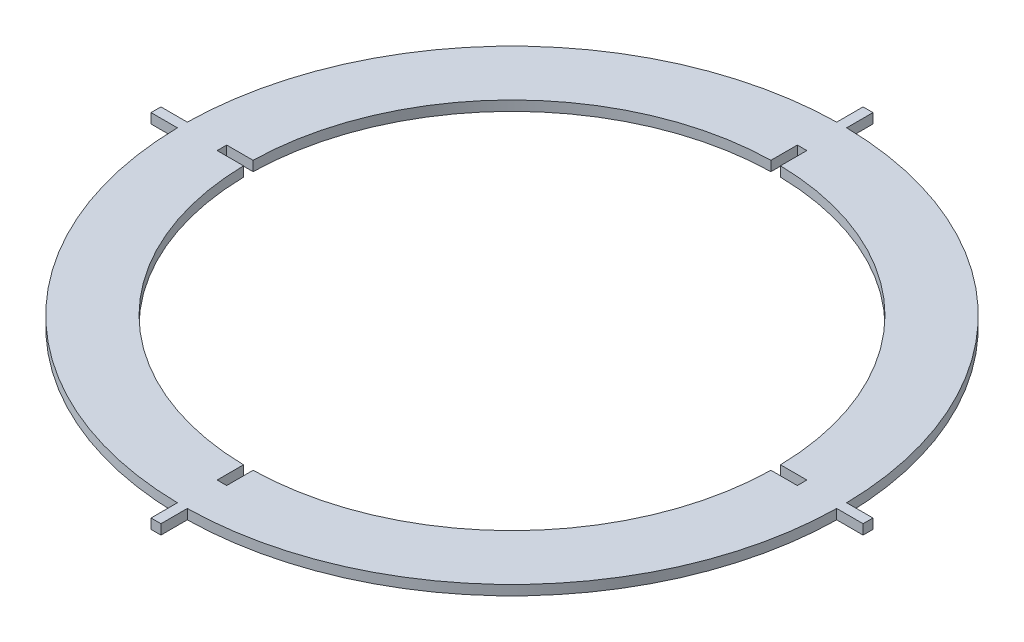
ISO-10303-21;
HEADER;
FILE_DESCRIPTION(('STEP AP214'),'2;1');
FILE_NAME('part.step','',(''),(''),'','','');
FILE_SCHEMA(('AUTOMOTIVE_DESIGN { 1 0 10303 214 1 1 1 1 }'));
ENDSEC;
DATA;
#1=APPLICATION_CONTEXT('core data for automotive mechanical design processes');
#2=APPLICATION_PROTOCOL_DEFINITION('international standard','automotive_design',2000,#1);
#3=PRODUCT_CONTEXT('',#1,'mechanical');
#4=PRODUCT('Part','Part','',(#3));
#5=PRODUCT_RELATED_PRODUCT_CATEGORY('part','',(#4));
#6=PRODUCT_DEFINITION_FORMATION('','',#4);
#7=PRODUCT_DEFINITION_CONTEXT('part definition',#1,'design');
#8=PRODUCT_DEFINITION('design','',#6,#7);
#9=PRODUCT_DEFINITION_SHAPE('','',#8);
#10=(LENGTH_UNIT() NAMED_UNIT(*) SI_UNIT(.MILLI.,.METRE.));
#11=(NAMED_UNIT(*) PLANE_ANGLE_UNIT() SI_UNIT($,.RADIAN.));
#12=(NAMED_UNIT(*) SI_UNIT($,.STERADIAN.) SOLID_ANGLE_UNIT());
#13=UNCERTAINTY_MEASURE_WITH_UNIT(LENGTH_MEASURE(1.E-05),#10,'distance_accuracy_value','');
#14=(GEOMETRIC_REPRESENTATION_CONTEXT(3) GLOBAL_UNCERTAINTY_ASSIGNED_CONTEXT((#13)) GLOBAL_UNIT_ASSIGNED_CONTEXT((#10,
#11,#12)) REPRESENTATION_CONTEXT('',''));
#15=CARTESIAN_POINT('',(0.,0.,0.));
#16=DIRECTION('',(0.,0.,1.));
#17=DIRECTION('',(1.,0.,0.));
#18=AXIS2_PLACEMENT_3D('',#15,#16,#17);
#19=CARTESIAN_POINT('',(0.,3.,-1.50000000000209));
#20=DIRECTION('',(0.,0.,1.));
#21=DIRECTION('',(1.,0.,0.));
#22=AXIS2_PLACEMENT_3D('',#19,#20,#21);
#23=PLANE('',#22);
#24=DIRECTION('',(-1.,0.,0.));
#25=VECTOR('',#24,1.);
#26=CARTESIAN_POINT('',(0.,0.,-1.50000000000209));
#27=LINE('',#26,#25);
#28=CARTESIAN_POINT('',(107.988749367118,0.,-1.5000000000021));
#29=VERTEX_POINT('',#28);
#30=CARTESIAN_POINT('',(99.9887493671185,0.,-1.5000000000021));
#31=VERTEX_POINT('',#30);
#32=EDGE_CURVE('E326',#29,#31,#27,.T.);
#33=ORIENTED_EDGE('',*,*,#32,.T.);
#34=DIRECTION('',(0.,-1.,0.));
#35=VECTOR('',#34,1.);
#36=CARTESIAN_POINT('',(99.9887493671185,3.,-1.5000000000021));
#37=LINE('',#36,#35);
#38=CARTESIAN_POINT('',(99.9887493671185,3.,-1.5000000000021));
#39=VERTEX_POINT('',#38);
#40=EDGE_CURVE('E11',#39,#31,#37,.T.);
#41=ORIENTED_EDGE('',*,*,#40,.F.);
#42=DIRECTION('',(-1.,0.,0.));
#43=VECTOR('',#42,1.);
#44=CARTESIAN_POINT('',(0.,3.,-1.50000000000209));
#45=LINE('',#44,#43);
#46=CARTESIAN_POINT('',(107.988749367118,3.,-1.5000000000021));
#47=VERTEX_POINT('',#46);
#48=EDGE_CURVE('E484',#47,#39,#45,.T.);
#49=ORIENTED_EDGE('',*,*,#48,.F.);
#50=DIRECTION('',(0.,-1.,0.));
#51=VECTOR('',#50,1.);
#52=CARTESIAN_POINT('',(107.988749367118,3.,-1.5000000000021));
#53=LINE('',#52,#51);
#54=EDGE_CURVE('E54',#47,#29,#53,.T.);
#55=ORIENTED_EDGE('',*,*,#54,.T.);
#56=EDGE_LOOP('',(#33,#41,#49,#55));
#57=FACE_BOUND('',#56,.T.);
#58=ADVANCED_FACE('F35',(#57),#23,.F.);
#59=CARTESIAN_POINT('',(0.,3.,0.));
#60=DIRECTION('',(0.,-1.,0.));
#61=DIRECTION('',(0.,0.,-1.));
#62=AXIS2_PLACEMENT_3D('',#59,#60,#61);
#63=CYLINDRICAL_SURFACE('',#62,100.000000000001);
#64=CARTESIAN_POINT('',(0.,0.,0.));
#65=DIRECTION('',(0.,1.,0.));
#66=DIRECTION('',(0.,0.,1.));
#67=AXIS2_PLACEMENT_3D('',#64,#65,#66);
#68=CIRCLE('',#67,100.000000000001);
#69=CARTESIAN_POINT('',(1.50000000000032,0.,-99.9887493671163));
#70=VERTEX_POINT('',#69);
#71=EDGE_CURVE('E328',#31,#70,#68,.T.);
#72=ORIENTED_EDGE('',*,*,#71,.T.);
#73=DIRECTION('',(0.,-1.,0.));
#74=VECTOR('',#73,1.);
#75=CARTESIAN_POINT('',(1.50000000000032,3.,-99.9887493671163));
#76=LINE('',#75,#74);
#77=CARTESIAN_POINT('',(1.50000000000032,3.,-99.9887493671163));
#78=VERTEX_POINT('',#77);
#79=EDGE_CURVE('E45',#78,#70,#76,.T.);
#80=ORIENTED_EDGE('',*,*,#79,.F.);
#81=CARTESIAN_POINT('',(0.,3.,0.));
#82=DIRECTION('',(0.,1.,0.));
#83=DIRECTION('',(0.,0.,1.));
#84=AXIS2_PLACEMENT_3D('',#81,#82,#83);
#85=CIRCLE('',#84,100.000000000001);
#86=EDGE_CURVE('E486',#39,#78,#85,.T.);
#87=ORIENTED_EDGE('',*,*,#86,.F.);
#88=ORIENTED_EDGE('',*,*,#40,.T.);
#89=EDGE_LOOP('',(#72,#80,#87,#88));
#90=FACE_BOUND('',#89,.T.);
#91=ADVANCED_FACE('F535',(#90),#63,.T.);
#92=CARTESIAN_POINT('',(1.49999999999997,3.,0.));
#93=DIRECTION('',(1.,0.,0.));
#94=DIRECTION('',(0.,0.,-1.));
#95=AXIS2_PLACEMENT_3D('',#92,#93,#94);
#96=PLANE('',#95);
#97=DIRECTION('',(0.,0.,1.));
#98=VECTOR('',#97,1.);
#99=CARTESIAN_POINT('',(1.49999999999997,0.,0.));
#100=LINE('',#99,#98);
#101=CARTESIAN_POINT('',(1.50000000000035,0.,-107.988749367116));
#102=VERTEX_POINT('',#101);
#103=EDGE_CURVE('E331',#102,#70,#100,.T.);
#104=ORIENTED_EDGE('',*,*,#103,.F.);
#105=DIRECTION('',(0.,-1.,0.));
#106=VECTOR('',#105,1.);
#107=CARTESIAN_POINT('',(1.50000000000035,3.,-107.988749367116));
#108=LINE('',#107,#106);
#109=CARTESIAN_POINT('',(1.50000000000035,3.,-107.988749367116));
#110=VERTEX_POINT('',#109);
#111=EDGE_CURVE('E391',#110,#102,#108,.T.);
#112=ORIENTED_EDGE('',*,*,#111,.F.);
#113=DIRECTION('',(0.,0.,1.));
#114=VECTOR('',#113,1.);
#115=CARTESIAN_POINT('',(1.49999999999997,3.,0.));
#116=LINE('',#115,#114);
#117=EDGE_CURVE('E488',#110,#78,#116,.T.);
#118=ORIENTED_EDGE('',*,*,#117,.T.);
#119=ORIENTED_EDGE('',*,*,#79,.T.);
#120=EDGE_LOOP('',(#104,#112,#118,#119));
#121=FACE_BOUND('',#120,.T.);
#122=ADVANCED_FACE('F540',(#121),#96,.T.);
#123=CARTESIAN_POINT('',(0.,3.,-107.988749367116));
#124=DIRECTION('',(0.,0.,-1.));
#125=DIRECTION('',(-1.,0.,0.));
#126=AXIS2_PLACEMENT_3D('',#123,#124,#125);
#127=PLANE('',#126);
#128=DIRECTION('',(1.,0.,0.));
#129=VECTOR('',#128,1.);
#130=CARTESIAN_POINT('',(0.,0.,-107.988749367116));
#131=LINE('',#130,#129);
#132=CARTESIAN_POINT('',(-1.49999999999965,0.,-107.988749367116));
#133=VERTEX_POINT('',#132);
#134=EDGE_CURVE('E334',#133,#102,#131,.T.);
#135=ORIENTED_EDGE('',*,*,#134,.F.);
#136=DIRECTION('',(0.,-1.,0.));
#137=VECTOR('',#136,1.);
#138=CARTESIAN_POINT('',(-1.49999999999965,3.,-107.988749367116));
#139=LINE('',#138,#137);
#140=CARTESIAN_POINT('',(-1.49999999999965,3.,-107.988749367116));
#141=VERTEX_POINT('',#140);
#142=EDGE_CURVE('E389',#141,#133,#139,.T.);
#143=ORIENTED_EDGE('',*,*,#142,.F.);
#144=DIRECTION('',(1.,0.,0.));
#145=VECTOR('',#144,1.);
#146=CARTESIAN_POINT('',(0.,3.,-107.988749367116));
#147=LINE('',#146,#145);
#148=EDGE_CURVE('E491',#141,#110,#147,.T.);
#149=ORIENTED_EDGE('',*,*,#148,.T.);
#150=ORIENTED_EDGE('',*,*,#111,.T.);
#151=EDGE_LOOP('',(#135,#143,#149,#150));
#152=FACE_BOUND('',#151,.T.);
#153=ADVANCED_FACE('F851',(#152),#127,.T.);
#154=CARTESIAN_POINT('',(-1.50000000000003,3.,0.));
#155=DIRECTION('',(1.,0.,0.));
#156=DIRECTION('',(0.,0.,-1.));
#157=AXIS2_PLACEMENT_3D('',#154,#155,#156);
#158=PLANE('',#157);
#159=DIRECTION('',(0.,0.,1.));
#160=VECTOR('',#159,1.);
#161=CARTESIAN_POINT('',(-1.50000000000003,0.,0.));
#162=LINE('',#161,#160);
#163=CARTESIAN_POINT('',(-1.49999999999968,0.,-99.9887493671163));
#164=VERTEX_POINT('',#163);
#165=EDGE_CURVE('E337',#133,#164,#162,.T.);
#166=ORIENTED_EDGE('',*,*,#165,.T.);
#167=DIRECTION('',(0.,-1.,0.));
#168=VECTOR('',#167,1.);
#169=CARTESIAN_POINT('',(-1.49999999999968,3.,-99.9887493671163));
#170=LINE('',#169,#168);
#171=CARTESIAN_POINT('',(-1.49999999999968,3.,-99.9887493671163));
#172=VERTEX_POINT('',#171);
#173=EDGE_CURVE('E386',#172,#164,#170,.T.);
#174=ORIENTED_EDGE('',*,*,#173,.F.);
#175=DIRECTION('',(0.,0.,1.));
#176=VECTOR('',#175,1.);
#177=CARTESIAN_POINT('',(-1.50000000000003,3.,0.));
#178=LINE('',#177,#176);
#179=EDGE_CURVE('E494',#141,#172,#178,.T.);
#180=ORIENTED_EDGE('',*,*,#179,.F.);
#181=ORIENTED_EDGE('',*,*,#142,.T.);
#182=EDGE_LOOP('',(#166,#174,#180,#181));
#183=FACE_BOUND('',#182,.T.);
#184=ADVANCED_FACE('F841',(#183),#158,.F.);
#185=CARTESIAN_POINT('',(0.,3.,0.));
#186=DIRECTION('',(0.,-1.,0.));
#187=DIRECTION('',(0.,0.,-1.));
#188=AXIS2_PLACEMENT_3D('',#185,#186,#187);
#189=CYLINDRICAL_SURFACE('',#188,100.);
#190=CARTESIAN_POINT('',(0.,0.,0.));
#191=DIRECTION('',(0.,1.,0.));
#192=DIRECTION('',(0.,0.,1.));
#193=AXIS2_PLACEMENT_3D('',#190,#191,#192);
#194=CIRCLE('',#193,100.);
#195=CARTESIAN_POINT('',(-99.9887493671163,0.,-1.49999999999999));
#196=VERTEX_POINT('',#195);
#197=EDGE_CURVE('E339',#164,#196,#194,.T.);
#198=ORIENTED_EDGE('',*,*,#197,.T.);
#199=DIRECTION('',(0.,-1.,0.));
#200=VECTOR('',#199,1.);
#201=CARTESIAN_POINT('',(-99.9887493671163,3.,-1.49999999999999));
#202=LINE('',#201,#200);
#203=CARTESIAN_POINT('',(-99.9887493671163,3.,-1.49999999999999));
#204=VERTEX_POINT('',#203);
#205=EDGE_CURVE('E384',#204,#196,#202,.T.);
#206=ORIENTED_EDGE('',*,*,#205,.F.);
#207=CARTESIAN_POINT('',(0.,3.,0.));
#208=DIRECTION('',(0.,1.,0.));
#209=DIRECTION('',(0.,0.,1.));
#210=AXIS2_PLACEMENT_3D('',#207,#208,#209);
#211=CIRCLE('',#210,100.);
#212=EDGE_CURVE('E496',#172,#204,#211,.T.);
#213=ORIENTED_EDGE('',*,*,#212,.F.);
#214=ORIENTED_EDGE('',*,*,#173,.T.);
#215=EDGE_LOOP('',(#198,#206,#213,#214));
#216=FACE_BOUND('',#215,.T.);
#217=ADVANCED_FACE('F831',(#216),#189,.T.);
#218=CARTESIAN_POINT('',(0.,3.,-1.49999999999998));
#219=DIRECTION('',(0.,0.,-1.));
#220=DIRECTION('',(-1.,0.,0.));
#221=AXIS2_PLACEMENT_3D('',#218,#219,#220);
#222=PLANE('',#221);
#223=DIRECTION('',(1.,0.,0.));
#224=VECTOR('',#223,1.);
#225=CARTESIAN_POINT('',(0.,0.,-1.49999999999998));
#226=LINE('',#225,#224);
#227=CARTESIAN_POINT('',(-107.988749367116,0.,-1.49999999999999));
#228=VERTEX_POINT('',#227);
#229=EDGE_CURVE('E342',#228,#196,#226,.T.);
#230=ORIENTED_EDGE('',*,*,#229,.F.);
#231=DIRECTION('',(0.,-1.,0.));
#232=VECTOR('',#231,1.);
#233=CARTESIAN_POINT('',(-107.988749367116,3.,-1.49999999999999));
#234=LINE('',#233,#232);
#235=CARTESIAN_POINT('',(-107.988749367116,3.,-1.49999999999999));
#236=VERTEX_POINT('',#235);
#237=EDGE_CURVE('E382',#236,#228,#234,.T.);
#238=ORIENTED_EDGE('',*,*,#237,.F.);
#239=DIRECTION('',(1.,0.,0.));
#240=VECTOR('',#239,1.);
#241=CARTESIAN_POINT('',(0.,3.,-1.49999999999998));
#242=LINE('',#241,#240);
#243=EDGE_CURVE('E498',#236,#204,#242,.T.);
#244=ORIENTED_EDGE('',*,*,#243,.T.);
#245=ORIENTED_EDGE('',*,*,#205,.T.);
#246=EDGE_LOOP('',(#230,#238,#244,#245));
#247=FACE_BOUND('',#246,.T.);
#248=ADVANCED_FACE('F821',(#247),#222,.T.);
#249=CARTESIAN_POINT('',(-107.988749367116,3.,0.));
#250=DIRECTION('',(-1.,0.,0.));
#251=DIRECTION('',(0.,0.,1.));
#252=AXIS2_PLACEMENT_3D('',#249,#250,#251);
#253=PLANE('',#252);
#254=DIRECTION('',(0.,0.,-1.));
#255=VECTOR('',#254,1.);
#256=CARTESIAN_POINT('',(-107.988749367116,0.,0.));
#257=LINE('',#256,#255);
#258=CARTESIAN_POINT('',(-107.988749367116,0.,1.50000000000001));
#259=VERTEX_POINT('',#258);
#260=EDGE_CURVE('E345',#259,#228,#257,.T.);
#261=ORIENTED_EDGE('',*,*,#260,.F.);
#262=DIRECTION('',(0.,-1.,0.));
#263=VECTOR('',#262,1.);
#264=CARTESIAN_POINT('',(-107.988749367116,3.,1.50000000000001));
#265=LINE('',#264,#263);
#266=CARTESIAN_POINT('',(-107.988749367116,3.,1.50000000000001));
#267=VERTEX_POINT('',#266);
#268=EDGE_CURVE('E380',#267,#259,#265,.T.);
#269=ORIENTED_EDGE('',*,*,#268,.F.);
#270=DIRECTION('',(0.,0.,-1.));
#271=VECTOR('',#270,1.);
#272=CARTESIAN_POINT('',(-107.988749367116,3.,0.));
#273=LINE('',#272,#271);
#274=EDGE_CURVE('E501',#267,#236,#273,.T.);
#275=ORIENTED_EDGE('',*,*,#274,.T.);
#276=ORIENTED_EDGE('',*,*,#237,.T.);
#277=EDGE_LOOP('',(#261,#269,#275,#276));
#278=FACE_BOUND('',#277,.T.);
#279=ADVANCED_FACE('F811',(#278),#253,.T.);
#280=CARTESIAN_POINT('',(0.,3.,1.50000000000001));
#281=DIRECTION('',(0.,0.,-1.));
#282=DIRECTION('',(-1.,0.,0.));
#283=AXIS2_PLACEMENT_3D('',#280,#281,#282);
#284=PLANE('',#283);
#285=DIRECTION('',(1.,0.,0.));
#286=VECTOR('',#285,1.);
#287=CARTESIAN_POINT('',(0.,0.,1.50000000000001));
#288=LINE('',#287,#286);
#289=CARTESIAN_POINT('',(-99.9887493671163,0.,1.50000000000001));
#290=VERTEX_POINT('',#289);
#291=EDGE_CURVE('E348',#259,#290,#288,.T.);
#292=ORIENTED_EDGE('',*,*,#291,.T.);
#293=DIRECTION('',(0.,-1.,0.));
#294=VECTOR('',#293,1.);
#295=CARTESIAN_POINT('',(-99.9887493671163,3.,1.50000000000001));
#296=LINE('',#295,#294);
#297=CARTESIAN_POINT('',(-99.9887493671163,3.,1.50000000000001));
#298=VERTEX_POINT('',#297);
#299=EDGE_CURVE('E377',#298,#290,#296,.T.);
#300=ORIENTED_EDGE('',*,*,#299,.F.);
#301=DIRECTION('',(1.,0.,0.));
#302=VECTOR('',#301,1.);
#303=CARTESIAN_POINT('',(0.,3.,1.50000000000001));
#304=LINE('',#303,#302);
#305=EDGE_CURVE('E504',#267,#298,#304,.T.);
#306=ORIENTED_EDGE('',*,*,#305,.F.);
#307=ORIENTED_EDGE('',*,*,#268,.T.);
#308=EDGE_LOOP('',(#292,#300,#306,#307));
#309=FACE_BOUND('',#308,.T.);
#310=ADVANCED_FACE('F801',(#309),#284,.F.);
#311=CARTESIAN_POINT('',(0.,3.,0.));
#312=DIRECTION('',(0.,-1.,0.));
#313=DIRECTION('',(0.,0.,-1.));
#314=AXIS2_PLACEMENT_3D('',#311,#312,#313);
#315=CYLINDRICAL_SURFACE('',#314,100.);
#316=CARTESIAN_POINT('',(0.,0.,0.));
#317=DIRECTION('',(0.,1.,0.));
#318=DIRECTION('',(0.,0.,1.));
#319=AXIS2_PLACEMENT_3D('',#316,#317,#318);
#320=CIRCLE('',#319,100.);
#321=CARTESIAN_POINT('',(-1.50000000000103,0.,99.9887493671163));
#322=VERTEX_POINT('',#321);
#323=EDGE_CURVE('E350',#290,#322,#320,.T.);
#324=ORIENTED_EDGE('',*,*,#323,.T.);
#325=DIRECTION('',(0.,-1.,0.));
#326=VECTOR('',#325,1.);
#327=CARTESIAN_POINT('',(-1.50000000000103,3.,99.9887493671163));
#328=LINE('',#327,#326);
#329=CARTESIAN_POINT('',(-1.50000000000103,3.,99.9887493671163));
#330=VERTEX_POINT('',#329);
#331=EDGE_CURVE('E375',#330,#322,#328,.T.);
#332=ORIENTED_EDGE('',*,*,#331,.F.);
#333=CARTESIAN_POINT('',(0.,3.,0.));
#334=DIRECTION('',(0.,1.,0.));
#335=DIRECTION('',(0.,0.,1.));
#336=AXIS2_PLACEMENT_3D('',#333,#334,#335);
#337=CIRCLE('',#336,100.);
#338=EDGE_CURVE('E506',#298,#330,#337,.T.);
#339=ORIENTED_EDGE('',*,*,#338,.F.);
#340=ORIENTED_EDGE('',*,*,#299,.T.);
#341=EDGE_LOOP('',(#324,#332,#339,#340));
#342=FACE_BOUND('',#341,.T.);
#343=ADVANCED_FACE('F791',(#342),#315,.T.);
#344=CARTESIAN_POINT('',(-1.49999999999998,3.,0.));
#345=DIRECTION('',(-1.,0.,0.));
#346=DIRECTION('',(0.,0.,1.));
#347=AXIS2_PLACEMENT_3D('',#344,#345,#346);
#348=PLANE('',#347);
#349=DIRECTION('',(0.,0.,-1.));
#350=VECTOR('',#349,1.);
#351=CARTESIAN_POINT('',(-1.49999999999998,0.,0.));
#352=LINE('',#351,#350);
#353=CARTESIAN_POINT('',(-1.50000000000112,0.,107.988749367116));
#354=VERTEX_POINT('',#353);
#355=EDGE_CURVE('E353',#354,#322,#352,.T.);
#356=ORIENTED_EDGE('',*,*,#355,.F.);
#357=DIRECTION('',(0.,-1.,0.));
#358=VECTOR('',#357,1.);
#359=CARTESIAN_POINT('',(-1.50000000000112,3.,107.988749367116));
#360=LINE('',#359,#358);
#361=CARTESIAN_POINT('',(-1.50000000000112,3.,107.988749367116));
#362=VERTEX_POINT('',#361);
#363=EDGE_CURVE('E373',#362,#354,#360,.T.);
#364=ORIENTED_EDGE('',*,*,#363,.F.);
#365=DIRECTION('',(0.,0.,-1.));
#366=VECTOR('',#365,1.);
#367=CARTESIAN_POINT('',(-1.49999999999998,3.,0.));
#368=LINE('',#367,#366);
#369=EDGE_CURVE('E508',#362,#330,#368,.T.);
#370=ORIENTED_EDGE('',*,*,#369,.T.);
#371=ORIENTED_EDGE('',*,*,#331,.T.);
#372=EDGE_LOOP('',(#356,#364,#370,#371));
#373=FACE_BOUND('',#372,.T.);
#374=ADVANCED_FACE('F521',(#373),#348,.T.);
#375=CARTESIAN_POINT('',(-9.99096632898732E-13,3.,107.988749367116));
#376=DIRECTION('',(0.,0.,1.));
#377=DIRECTION('',(1.,0.,0.));
#378=AXIS2_PLACEMENT_3D('',#375,#376,#377);
#379=PLANE('',#378);
#380=DIRECTION('',(-1.,0.,0.));
#381=VECTOR('',#380,1.);
#382=CARTESIAN_POINT('',(-9.99096632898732E-13,0.,107.988749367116));
#383=LINE('',#382,#381);
#384=CARTESIAN_POINT('',(1.49999999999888,0.,107.988749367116));
#385=VERTEX_POINT('',#384);
#386=EDGE_CURVE('E356',#385,#354,#383,.T.);
#387=ORIENTED_EDGE('',*,*,#386,.F.);
#388=DIRECTION('',(0.,-1.,0.));
#389=VECTOR('',#388,1.);
#390=CARTESIAN_POINT('',(1.49999999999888,3.,107.988749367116));
#391=LINE('',#390,#389);
#392=CARTESIAN_POINT('',(1.49999999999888,3.,107.988749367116));
#393=VERTEX_POINT('',#392);
#394=EDGE_CURVE('E371',#393,#385,#391,.T.);
#395=ORIENTED_EDGE('',*,*,#394,.F.);
#396=DIRECTION('',(-1.,0.,0.));
#397=VECTOR('',#396,1.);
#398=CARTESIAN_POINT('',(-9.99096632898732E-13,3.,107.988749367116));
#399=LINE('',#398,#397);
#400=EDGE_CURVE('E511',#393,#362,#399,.T.);
#401=ORIENTED_EDGE('',*,*,#400,.T.);
#402=ORIENTED_EDGE('',*,*,#363,.T.);
#403=EDGE_LOOP('',(#387,#395,#401,#402));
#404=FACE_BOUND('',#403,.T.);
#405=ADVANCED_FACE('F515',(#404),#379,.T.);
#406=CARTESIAN_POINT('',(1.50000000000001,3.,0.));
#407=DIRECTION('',(-1.,0.,0.));
#408=DIRECTION('',(0.,0.,1.));
#409=AXIS2_PLACEMENT_3D('',#406,#407,#408);
#410=PLANE('',#409);
#411=DIRECTION('',(0.,0.,-1.));
#412=VECTOR('',#411,1.);
#413=CARTESIAN_POINT('',(1.50000000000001,0.,0.));
#414=LINE('',#413,#412);
#415=CARTESIAN_POINT('',(1.49999999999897,0.,99.9887493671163));
#416=VERTEX_POINT('',#415);
#417=EDGE_CURVE('E359',#385,#416,#414,.T.);
#418=ORIENTED_EDGE('',*,*,#417,.T.);
#419=DIRECTION('',(0.,-1.,0.));
#420=VECTOR('',#419,1.);
#421=CARTESIAN_POINT('',(1.49999999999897,3.,99.9887493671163));
#422=LINE('',#421,#420);
#423=CARTESIAN_POINT('',(1.49999999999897,3.,99.9887493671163));
#424=VERTEX_POINT('',#423);
#425=EDGE_CURVE('E273',#424,#416,#422,.T.);
#426=ORIENTED_EDGE('',*,*,#425,.F.);
#427=DIRECTION('',(0.,0.,-1.));
#428=VECTOR('',#427,1.);
#429=CARTESIAN_POINT('',(1.50000000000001,3.,0.));
#430=LINE('',#429,#428);
#431=EDGE_CURVE('E261',#393,#424,#430,.T.);
#432=ORIENTED_EDGE('',*,*,#431,.F.);
#433=ORIENTED_EDGE('',*,*,#394,.T.);
#434=EDGE_LOOP('',(#418,#426,#432,#433));
#435=FACE_BOUND('',#434,.T.);
#436=ADVANCED_FACE('F525',(#435),#410,.F.);
#437=CARTESIAN_POINT('',(0.,3.,0.));
#438=DIRECTION('',(0.,-1.,0.));
#439=DIRECTION('',(0.,0.,-1.));
#440=AXIS2_PLACEMENT_3D('',#437,#438,#439);
#441=CYLINDRICAL_SURFACE('',#440,100.000000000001);
#442=CARTESIAN_POINT('',(0.,0.,0.));
#443=DIRECTION('',(0.,1.,0.));
#444=DIRECTION('',(0.,0.,1.));
#445=AXIS2_PLACEMENT_3D('',#442,#443,#444);
#446=CIRCLE('',#445,100.000000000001);
#447=CARTESIAN_POINT('',(99.9887493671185,0.,1.4999999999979));
#448=VERTEX_POINT('',#447);
#449=EDGE_CURVE('E270',#416,#448,#446,.T.);
#450=ORIENTED_EDGE('',*,*,#449,.T.);
#451=DIRECTION('',(0.,-1.,0.));
#452=VECTOR('',#451,1.);
#453=CARTESIAN_POINT('',(99.9887493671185,3.,1.4999999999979));
#454=LINE('',#453,#452);
#455=CARTESIAN_POINT('',(99.9887493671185,3.,1.4999999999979));
#456=VERTEX_POINT('',#455);
#457=EDGE_CURVE('E267',#456,#448,#454,.T.);
#458=ORIENTED_EDGE('',*,*,#457,.F.);
#459=CARTESIAN_POINT('',(0.,3.,0.));
#460=DIRECTION('',(0.,1.,0.));
#461=DIRECTION('',(0.,0.,1.));
#462=AXIS2_PLACEMENT_3D('',#459,#460,#461);
#463=CIRCLE('',#462,100.000000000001);
#464=EDGE_CURVE('E252',#424,#456,#463,.T.);
#465=ORIENTED_EDGE('',*,*,#464,.F.);
#466=ORIENTED_EDGE('',*,*,#425,.T.);
#467=EDGE_LOOP('',(#450,#458,#465,#466));
#468=FACE_BOUND('',#467,.T.);
#469=ADVANCED_FACE('F268',(#468),#441,.T.);
#470=CARTESIAN_POINT('',(0.,3.,1.49999999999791));
#471=DIRECTION('',(0.,0.,1.));
#472=DIRECTION('',(1.,0.,0.));
#473=AXIS2_PLACEMENT_3D('',#470,#471,#472);
#474=PLANE('',#473);
#475=DIRECTION('',(-1.,0.,0.));
#476=VECTOR('',#475,1.);
#477=CARTESIAN_POINT('',(0.,0.,1.49999999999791));
#478=LINE('',#477,#476);
#479=CARTESIAN_POINT('',(107.988749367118,0.,1.4999999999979));
#480=VERTEX_POINT('',#479);
#481=EDGE_CURVE('E362',#480,#448,#478,.T.);
#482=ORIENTED_EDGE('',*,*,#481,.F.);
#483=DIRECTION('',(0.,-1.,0.));
#484=VECTOR('',#483,1.);
#485=CARTESIAN_POINT('',(107.988749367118,3.,1.4999999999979));
#486=LINE('',#485,#484);
#487=CARTESIAN_POINT('',(107.988749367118,3.,1.4999999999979));
#488=VERTEX_POINT('',#487);
#489=EDGE_CURVE('E152',#488,#480,#486,.T.);
#490=ORIENTED_EDGE('',*,*,#489,.F.);
#491=DIRECTION('',(-1.,0.,0.));
#492=VECTOR('',#491,1.);
#493=CARTESIAN_POINT('',(0.,3.,1.49999999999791));
#494=LINE('',#493,#492);
#495=EDGE_CURVE('E258',#488,#456,#494,.T.);
#496=ORIENTED_EDGE('',*,*,#495,.T.);
#497=ORIENTED_EDGE('',*,*,#457,.T.);
#498=EDGE_LOOP('',(#482,#490,#496,#497));
#499=FACE_BOUND('',#498,.T.);
#500=ADVANCED_FACE('F275',(#499),#474,.T.);
#501=CARTESIAN_POINT('',(0.,3.,0.));
#502=DIRECTION('',(0.,-1.,0.));
#503=DIRECTION('',(0.,0.,-1.));
#504=AXIS2_PLACEMENT_3D('',#501,#502,#503);
#505=CYLINDRICAL_SURFACE('',#504,80.);
#506=CARTESIAN_POINT('',(0.,0.,0.));
#507=DIRECTION('',(0.,1.,0.));
#508=DIRECTION('',(0.,0.,1.));
#509=AXIS2_PLACEMENT_3D('',#506,#507,#508);
#510=CIRCLE('',#509,80.);
#511=CARTESIAN_POINT('',(79.9868582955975,0.,-1.45000000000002));
#512=VERTEX_POINT('',#511);
#513=CARTESIAN_POINT('',(1.44999999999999,0.,-79.9868582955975));
#514=VERTEX_POINT('',#513);
#515=EDGE_CURVE('E282',#512,#514,#510,.T.);
#516=ORIENTED_EDGE('',*,*,#515,.F.);
#517=DIRECTION('',(0.,-1.,0.));
#518=VECTOR('',#517,1.);
#519=CARTESIAN_POINT('',(79.9868582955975,3.,-1.45000000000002));
#520=LINE('',#519,#518);
#521=CARTESIAN_POINT('',(79.9868582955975,3.,-1.45000000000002));
#522=VERTEX_POINT('',#521);
#523=EDGE_CURVE('E39',#522,#512,#520,.T.);
#524=ORIENTED_EDGE('',*,*,#523,.F.);
#525=CARTESIAN_POINT('',(0.,3.,0.));
#526=DIRECTION('',(0.,1.,0.));
#527=DIRECTION('',(0.,0.,1.));
#528=AXIS2_PLACEMENT_3D('',#525,#526,#527);
#529=CIRCLE('',#528,80.);
#530=CARTESIAN_POINT('',(1.44999999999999,3.,-79.9868582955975));
#531=VERTEX_POINT('',#530);
#532=EDGE_CURVE('E367',#522,#531,#529,.T.);
#533=ORIENTED_EDGE('',*,*,#532,.T.);
#534=DIRECTION('',(0.,-1.,0.));
#535=VECTOR('',#534,1.);
#536=CARTESIAN_POINT('',(1.44999999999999,3.,-79.9868582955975));
#537=LINE('',#536,#535);
#538=EDGE_CURVE('E278',#531,#514,#537,.T.);
#539=ORIENTED_EDGE('',*,*,#538,.T.);
#540=EDGE_LOOP('',(#516,#524,#533,#539));
#541=FACE_BOUND('',#540,.T.);
#542=ADVANCED_FACE('F37',(#541),#505,.F.);
#543=CARTESIAN_POINT('',(0.,3.,-1.45000000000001));
#544=DIRECTION('',(0.,0.,1.));
#545=DIRECTION('',(1.,0.,0.));
#546=AXIS2_PLACEMENT_3D('',#543,#544,#545);
#547=PLANE('',#546);
#548=DIRECTION('',(-1.,0.,0.));
#549=VECTOR('',#548,1.);
#550=CARTESIAN_POINT('',(0.,0.,-1.45000000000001));
#551=LINE('',#550,#549);
#552=CARTESIAN_POINT('',(87.9868582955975,0.,-1.45000000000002));
#553=VERTEX_POINT('',#552);
#554=EDGE_CURVE('E285',#553,#512,#551,.T.);
#555=ORIENTED_EDGE('',*,*,#554,.F.);
#556=DIRECTION('',(0.,-1.,0.));
#557=VECTOR('',#556,1.);
#558=CARTESIAN_POINT('',(87.9868582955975,3.,-1.45000000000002));
#559=LINE('',#558,#557);
#560=CARTESIAN_POINT('',(87.9868582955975,3.,-1.45000000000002));
#561=VERTEX_POINT('',#560);
#562=EDGE_CURVE('E424',#561,#553,#559,.T.);
#563=ORIENTED_EDGE('',*,*,#562,.F.);
#564=DIRECTION('',(-1.,0.,0.));
#565=VECTOR('',#564,1.);
#566=CARTESIAN_POINT('',(0.,3.,-1.45000000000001));
#567=LINE('',#566,#565);
#568=EDGE_CURVE('E433',#561,#522,#567,.T.);
#569=ORIENTED_EDGE('',*,*,#568,.T.);
#570=ORIENTED_EDGE('',*,*,#523,.T.);
#571=EDGE_LOOP('',(#555,#563,#569,#570));
#572=FACE_BOUND('',#571,.T.);
#573=ADVANCED_FACE('F431',(#572),#547,.T.);
#574=CARTESIAN_POINT('',(87.9868582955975,3.,4.2105618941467E-13));
#575=DIRECTION('',(1.,0.,0.));
#576=DIRECTION('',(0.,0.,-1.));
#577=AXIS2_PLACEMENT_3D('',#574,#575,#576);
#578=PLANE('',#577);
#579=DIRECTION('',(0.,0.,1.));
#580=VECTOR('',#579,1.);
#581=CARTESIAN_POINT('',(87.9868582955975,0.,4.2105618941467E-13));
#582=LINE('',#581,#580);
#583=CARTESIAN_POINT('',(87.9868582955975,0.,1.44999999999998));
#584=VERTEX_POINT('',#583);
#585=EDGE_CURVE('E288',#553,#584,#582,.T.);
#586=ORIENTED_EDGE('',*,*,#585,.T.);
#587=DIRECTION('',(0.,-1.,0.));
#588=VECTOR('',#587,1.);
#589=CARTESIAN_POINT('',(87.9868582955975,3.,1.44999999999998));
#590=LINE('',#589,#588);
#591=CARTESIAN_POINT('',(87.9868582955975,3.,1.44999999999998));
#592=VERTEX_POINT('',#591);
#593=EDGE_CURVE('E422',#592,#584,#590,.T.);
#594=ORIENTED_EDGE('',*,*,#593,.F.);
#595=DIRECTION('',(0.,0.,1.));
#596=VECTOR('',#595,1.);
#597=CARTESIAN_POINT('',(87.9868582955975,3.,4.2105618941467E-13));
#598=LINE('',#597,#596);
#599=EDGE_CURVE('E451',#561,#592,#598,.T.);
#600=ORIENTED_EDGE('',*,*,#599,.F.);
#601=ORIENTED_EDGE('',*,*,#562,.T.);
#602=EDGE_LOOP('',(#586,#594,#600,#601));
#603=FACE_BOUND('',#602,.T.);
#604=ADVANCED_FACE('F441',(#603),#578,.F.);
#605=CARTESIAN_POINT('',(0.,3.,1.45000000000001));
#606=DIRECTION('',(0.,0.,1.));
#607=DIRECTION('',(1.,0.,0.));
#608=AXIS2_PLACEMENT_3D('',#605,#606,#607);
#609=PLANE('',#608);
#610=DIRECTION('',(-1.,0.,0.));
#611=VECTOR('',#610,1.);
#612=CARTESIAN_POINT('',(0.,0.,1.45000000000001));
#613=LINE('',#612,#611);
#614=CARTESIAN_POINT('',(79.9868582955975,0.,1.44999999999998));
#615=VERTEX_POINT('',#614);
#616=EDGE_CURVE('E290',#584,#615,#613,.T.);
#617=ORIENTED_EDGE('',*,*,#616,.T.);
#618=DIRECTION('',(0.,-1.,0.));
#619=VECTOR('',#618,1.);
#620=CARTESIAN_POINT('',(79.9868582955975,3.,1.44999999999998));
#621=LINE('',#620,#619);
#622=CARTESIAN_POINT('',(79.9868582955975,3.,1.44999999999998));
#623=VERTEX_POINT('',#622);
#624=EDGE_CURVE('E420',#623,#615,#621,.T.);
#625=ORIENTED_EDGE('',*,*,#624,.F.);
#626=DIRECTION('',(-1.,0.,0.));
#627=VECTOR('',#626,1.);
#628=CARTESIAN_POINT('',(0.,3.,1.45000000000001));
#629=LINE('',#628,#627);
#630=EDGE_CURVE('E446',#592,#623,#629,.T.);
#631=ORIENTED_EDGE('',*,*,#630,.F.);
#632=ORIENTED_EDGE('',*,*,#593,.T.);
#633=EDGE_LOOP('',(#617,#625,#631,#632));
#634=FACE_BOUND('',#633,.T.);
#635=ADVANCED_FACE('F444',(#634),#609,.F.);
#636=CARTESIAN_POINT('',(0.,3.,0.));
#637=DIRECTION('',(0.,-1.,0.));
#638=DIRECTION('',(0.,0.,-1.));
#639=AXIS2_PLACEMENT_3D('',#636,#637,#638);
#640=CYLINDRICAL_SURFACE('',#639,80.);
#641=CARTESIAN_POINT('',(0.,0.,0.));
#642=DIRECTION('',(0.,1.,0.));
#643=DIRECTION('',(0.,0.,1.));
#644=AXIS2_PLACEMENT_3D('',#641,#642,#643);
#645=CIRCLE('',#644,80.);
#646=CARTESIAN_POINT('',(1.45000000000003,0.,79.9868582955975));
#647=VERTEX_POINT('',#646);
#648=EDGE_CURVE('E293',#647,#615,#645,.T.);
#649=ORIENTED_EDGE('',*,*,#648,.F.);
#650=DIRECTION('',(0.,-1.,0.));
#651=VECTOR('',#650,1.);
#652=CARTESIAN_POINT('',(1.45000000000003,3.,79.9868582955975));
#653=LINE('',#652,#651);
#654=CARTESIAN_POINT('',(1.45000000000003,3.,79.9868582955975));
#655=VERTEX_POINT('',#654);
#656=EDGE_CURVE('E418',#655,#647,#653,.T.);
#657=ORIENTED_EDGE('',*,*,#656,.F.);
#658=CARTESIAN_POINT('',(0.,3.,0.));
#659=DIRECTION('',(0.,1.,0.));
#660=DIRECTION('',(0.,0.,1.));
#661=AXIS2_PLACEMENT_3D('',#658,#659,#660);
#662=CIRCLE('',#661,80.);
#663=EDGE_CURVE('E450',#655,#623,#662,.T.);
#664=ORIENTED_EDGE('',*,*,#663,.T.);
#665=ORIENTED_EDGE('',*,*,#624,.T.);
#666=EDGE_LOOP('',(#649,#657,#664,#665));
#667=FACE_BOUND('',#666,.T.);
#668=ADVANCED_FACE('F589',(#667),#640,.F.);
#669=CARTESIAN_POINT('',(1.45000000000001,3.,0.));
#670=DIRECTION('',(-1.,0.,0.));
#671=DIRECTION('',(0.,0.,1.));
#672=AXIS2_PLACEMENT_3D('',#669,#670,#671);
#673=PLANE('',#672);
#674=DIRECTION('',(0.,0.,-1.));
#675=VECTOR('',#674,1.);
#676=CARTESIAN_POINT('',(1.45000000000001,0.,0.));
#677=LINE('',#676,#675);
#678=CARTESIAN_POINT('',(1.45000000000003,0.,87.9868582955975));
#679=VERTEX_POINT('',#678);
#680=EDGE_CURVE('E296',#679,#647,#677,.T.);
#681=ORIENTED_EDGE('',*,*,#680,.F.);
#682=DIRECTION('',(0.,-1.,0.));
#683=VECTOR('',#682,1.);
#684=CARTESIAN_POINT('',(1.45000000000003,3.,87.9868582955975));
#685=LINE('',#684,#683);
#686=CARTESIAN_POINT('',(1.45000000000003,3.,87.9868582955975));
#687=VERTEX_POINT('',#686);
#688=EDGE_CURVE('E416',#687,#679,#685,.T.);
#689=ORIENTED_EDGE('',*,*,#688,.F.);
#690=DIRECTION('',(0.,0.,-1.));
#691=VECTOR('',#690,1.);
#692=CARTESIAN_POINT('',(1.45000000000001,3.,0.));
#693=LINE('',#692,#691);
#694=EDGE_CURVE('E453',#687,#655,#693,.T.);
#695=ORIENTED_EDGE('',*,*,#694,.T.);
#696=ORIENTED_EDGE('',*,*,#656,.T.);
#697=EDGE_LOOP('',(#681,#689,#695,#696));
#698=FACE_BOUND('',#697,.T.);
#699=ADVANCED_FACE('F585',(#698),#673,.T.);
#700=CARTESIAN_POINT('',(-4.2105618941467E-13,3.,87.9868582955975));
#701=DIRECTION('',(0.,0.,1.));
#702=DIRECTION('',(1.,0.,0.));
#703=AXIS2_PLACEMENT_3D('',#700,#701,#702);
#704=PLANE('',#703);
#705=DIRECTION('',(-1.,0.,0.));
#706=VECTOR('',#705,1.);
#707=CARTESIAN_POINT('',(-4.2105618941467E-13,0.,87.9868582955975));
#708=LINE('',#707,#706);
#709=CARTESIAN_POINT('',(-1.44999999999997,0.,87.9868582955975));
#710=VERTEX_POINT('',#709);
#711=EDGE_CURVE('E299',#679,#710,#708,.T.);
#712=ORIENTED_EDGE('',*,*,#711,.T.);
#713=DIRECTION('',(0.,-1.,0.));
#714=VECTOR('',#713,1.);
#715=CARTESIAN_POINT('',(-1.44999999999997,3.,87.9868582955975));
#716=LINE('',#715,#714);
#717=CARTESIAN_POINT('',(-1.44999999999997,3.,87.9868582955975));
#718=VERTEX_POINT('',#717);
#719=EDGE_CURVE('E413',#718,#710,#716,.T.);
#720=ORIENTED_EDGE('',*,*,#719,.F.);
#721=DIRECTION('',(-1.,0.,0.));
#722=VECTOR('',#721,1.);
#723=CARTESIAN_POINT('',(-4.2105618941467E-13,3.,87.9868582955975));
#724=LINE('',#723,#722);
#725=EDGE_CURVE('E460',#687,#718,#724,.T.);
#726=ORIENTED_EDGE('',*,*,#725,.F.);
#727=ORIENTED_EDGE('',*,*,#688,.T.);
#728=EDGE_LOOP('',(#712,#720,#726,#727));
#729=FACE_BOUND('',#728,.T.);
#730=ADVANCED_FACE('F581',(#729),#704,.F.);
#731=CARTESIAN_POINT('',(-1.45000000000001,3.,0.));
#732=DIRECTION('',(-1.,0.,0.));
#733=DIRECTION('',(0.,0.,1.));
#734=AXIS2_PLACEMENT_3D('',#731,#732,#733);
#735=PLANE('',#734);
#736=DIRECTION('',(0.,0.,-1.));
#737=VECTOR('',#736,1.);
#738=CARTESIAN_POINT('',(-1.45000000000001,0.,0.));
#739=LINE('',#738,#737);
#740=CARTESIAN_POINT('',(-1.44999999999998,0.,79.9868582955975));
#741=VERTEX_POINT('',#740);
#742=EDGE_CURVE('E301',#710,#741,#739,.T.);
#743=ORIENTED_EDGE('',*,*,#742,.T.);
#744=DIRECTION('',(0.,-1.,0.));
#745=VECTOR('',#744,1.);
#746=CARTESIAN_POINT('',(-1.44999999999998,3.,79.9868582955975));
#747=LINE('',#746,#745);
#748=CARTESIAN_POINT('',(-1.44999999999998,3.,79.9868582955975));
#749=VERTEX_POINT('',#748);
#750=EDGE_CURVE('E411',#749,#741,#747,.T.);
#751=ORIENTED_EDGE('',*,*,#750,.F.);
#752=DIRECTION('',(0.,0.,-1.));
#753=VECTOR('',#752,1.);
#754=CARTESIAN_POINT('',(-1.45000000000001,3.,0.));
#755=LINE('',#754,#753);
#756=EDGE_CURVE('E462',#718,#749,#755,.T.);
#757=ORIENTED_EDGE('',*,*,#756,.F.);
#758=ORIENTED_EDGE('',*,*,#719,.T.);
#759=EDGE_LOOP('',(#743,#751,#757,#758));
#760=FACE_BOUND('',#759,.T.);
#761=ADVANCED_FACE('F577',(#760),#735,.F.);
#762=CARTESIAN_POINT('',(0.,3.,0.));
#763=DIRECTION('',(0.,-1.,0.));
#764=DIRECTION('',(0.,0.,-1.));
#765=AXIS2_PLACEMENT_3D('',#762,#763,#764);
#766=CYLINDRICAL_SURFACE('',#765,80.);
#767=CARTESIAN_POINT('',(0.,0.,0.));
#768=DIRECTION('',(0.,1.,0.));
#769=DIRECTION('',(0.,0.,1.));
#770=AXIS2_PLACEMENT_3D('',#767,#768,#769);
#771=CIRCLE('',#770,80.);
#772=CARTESIAN_POINT('',(-79.9868582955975,0.,1.45000000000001));
#773=VERTEX_POINT('',#772);
#774=EDGE_CURVE('E304',#773,#741,#771,.T.);
#775=ORIENTED_EDGE('',*,*,#774,.F.);
#776=DIRECTION('',(0.,-1.,0.));
#777=VECTOR('',#776,1.);
#778=CARTESIAN_POINT('',(-79.9868582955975,3.,1.45000000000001));
#779=LINE('',#778,#777);
#780=CARTESIAN_POINT('',(-79.9868582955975,3.,1.45000000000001));
#781=VERTEX_POINT('',#780);
#782=EDGE_CURVE('E409',#781,#773,#779,.T.);
#783=ORIENTED_EDGE('',*,*,#782,.F.);
#784=CARTESIAN_POINT('',(0.,3.,0.));
#785=DIRECTION('',(0.,1.,0.));
#786=DIRECTION('',(0.,0.,1.));
#787=AXIS2_PLACEMENT_3D('',#784,#785,#786);
#788=CIRCLE('',#787,80.);
#789=EDGE_CURVE('E464',#781,#749,#788,.T.);
#790=ORIENTED_EDGE('',*,*,#789,.T.);
#791=ORIENTED_EDGE('',*,*,#750,.T.);
#792=EDGE_LOOP('',(#775,#783,#790,#791));
#793=FACE_BOUND('',#792,.T.);
#794=ADVANCED_FACE('F573',(#793),#766,.F.);
#795=CARTESIAN_POINT('',(0.,3.,1.45000000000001));
#796=DIRECTION('',(0.,0.,-1.));
#797=DIRECTION('',(-1.,0.,0.));
#798=AXIS2_PLACEMENT_3D('',#795,#796,#797);
#799=PLANE('',#798);
#800=DIRECTION('',(1.,0.,0.));
#801=VECTOR('',#800,1.);
#802=CARTESIAN_POINT('',(0.,0.,1.45000000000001));
#803=LINE('',#802,#801);
#804=CARTESIAN_POINT('',(-87.9868582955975,0.,1.45000000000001));
#805=VERTEX_POINT('',#804);
#806=EDGE_CURVE('E307',#805,#773,#803,.T.);
#807=ORIENTED_EDGE('',*,*,#806,.F.);
#808=DIRECTION('',(0.,-1.,0.));
#809=VECTOR('',#808,1.);
#810=CARTESIAN_POINT('',(-87.9868582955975,3.,1.45000000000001));
#811=LINE('',#810,#809);
#812=CARTESIAN_POINT('',(-87.9868582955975,3.,1.45000000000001));
#813=VERTEX_POINT('',#812);
#814=EDGE_CURVE('E407',#813,#805,#811,.T.);
#815=ORIENTED_EDGE('',*,*,#814,.F.);
#816=DIRECTION('',(1.,0.,0.));
#817=VECTOR('',#816,1.);
#818=CARTESIAN_POINT('',(0.,3.,1.45000000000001));
#819=LINE('',#818,#817);
#820=EDGE_CURVE('E467',#813,#781,#819,.T.);
#821=ORIENTED_EDGE('',*,*,#820,.T.);
#822=ORIENTED_EDGE('',*,*,#782,.T.);
#823=EDGE_LOOP('',(#807,#815,#821,#822));
#824=FACE_BOUND('',#823,.T.);
#825=ADVANCED_FACE('F569',(#824),#799,.T.);
#826=CARTESIAN_POINT('',(-87.9868582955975,3.,-4.2105618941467E-13));
#827=DIRECTION('',(-1.,0.,0.));
#828=DIRECTION('',(0.,0.,1.));
#829=AXIS2_PLACEMENT_3D('',#826,#827,#828);
#830=PLANE('',#829);
#831=DIRECTION('',(0.,0.,-1.));
#832=VECTOR('',#831,1.);
#833=CARTESIAN_POINT('',(-87.9868582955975,0.,-4.2105618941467E-13));
#834=LINE('',#833,#832);
#835=CARTESIAN_POINT('',(-87.9868582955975,0.,-1.44999999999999));
#836=VERTEX_POINT('',#835);
#837=EDGE_CURVE('E310',#805,#836,#834,.T.);
#838=ORIENTED_EDGE('',*,*,#837,.T.);
#839=DIRECTION('',(0.,-1.,0.));
#840=VECTOR('',#839,1.);
#841=CARTESIAN_POINT('',(-87.9868582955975,3.,-1.44999999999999));
#842=LINE('',#841,#840);
#843=CARTESIAN_POINT('',(-87.9868582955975,3.,-1.44999999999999));
#844=VERTEX_POINT('',#843);
#845=EDGE_CURVE('E404',#844,#836,#842,.T.);
#846=ORIENTED_EDGE('',*,*,#845,.F.);
#847=DIRECTION('',(0.,0.,-1.));
#848=VECTOR('',#847,1.);
#849=CARTESIAN_POINT('',(-87.9868582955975,3.,-4.2105618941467E-13));
#850=LINE('',#849,#848);
#851=EDGE_CURVE('E470',#813,#844,#850,.T.);
#852=ORIENTED_EDGE('',*,*,#851,.F.);
#853=ORIENTED_EDGE('',*,*,#814,.T.);
#854=EDGE_LOOP('',(#838,#846,#852,#853));
#855=FACE_BOUND('',#854,.T.);
#856=ADVANCED_FACE('F565',(#855),#830,.F.);
#857=CARTESIAN_POINT('',(0.,3.,-1.45000000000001));
#858=DIRECTION('',(0.,0.,-1.));
#859=DIRECTION('',(-1.,0.,0.));
#860=AXIS2_PLACEMENT_3D('',#857,#858,#859);
#861=PLANE('',#860);
#862=DIRECTION('',(1.,0.,0.));
#863=VECTOR('',#862,1.);
#864=CARTESIAN_POINT('',(0.,0.,-1.45000000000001));
#865=LINE('',#864,#863);
#866=CARTESIAN_POINT('',(-79.9868582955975,0.,-1.44999999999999));
#867=VERTEX_POINT('',#866);
#868=EDGE_CURVE('E312',#836,#867,#865,.T.);
#869=ORIENTED_EDGE('',*,*,#868,.T.);
#870=DIRECTION('',(0.,-1.,0.));
#871=VECTOR('',#870,1.);
#872=CARTESIAN_POINT('',(-79.9868582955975,3.,-1.44999999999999));
#873=LINE('',#872,#871);
#874=CARTESIAN_POINT('',(-79.9868582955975,3.,-1.44999999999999));
#875=VERTEX_POINT('',#874);
#876=EDGE_CURVE('E402',#875,#867,#873,.T.);
#877=ORIENTED_EDGE('',*,*,#876,.F.);
#878=DIRECTION('',(1.,0.,0.));
#879=VECTOR('',#878,1.);
#880=CARTESIAN_POINT('',(0.,3.,-1.45000000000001));
#881=LINE('',#880,#879);
#882=EDGE_CURVE('E472',#844,#875,#881,.T.);
#883=ORIENTED_EDGE('',*,*,#882,.F.);
#884=ORIENTED_EDGE('',*,*,#845,.T.);
#885=EDGE_LOOP('',(#869,#877,#883,#884));
#886=FACE_BOUND('',#885,.T.);
#887=ADVANCED_FACE('F561',(#886),#861,.F.);
#888=CARTESIAN_POINT('',(0.,3.,0.));
#889=DIRECTION('',(0.,-1.,0.));
#890=DIRECTION('',(0.,0.,-1.));
#891=AXIS2_PLACEMENT_3D('',#888,#889,#890);
#892=CYLINDRICAL_SURFACE('',#891,80.);
#893=CARTESIAN_POINT('',(0.,0.,0.));
#894=DIRECTION('',(0.,1.,0.));
#895=DIRECTION('',(0.,0.,1.));
#896=AXIS2_PLACEMENT_3D('',#893,#894,#895);
#897=CIRCLE('',#896,80.);
#898=CARTESIAN_POINT('',(-1.45000000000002,0.,-79.9868582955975));
#899=VERTEX_POINT('',#898);
#900=EDGE_CURVE('E315',#899,#867,#897,.T.);
#901=ORIENTED_EDGE('',*,*,#900,.F.);
#902=DIRECTION('',(0.,-1.,0.));
#903=VECTOR('',#902,1.);
#904=CARTESIAN_POINT('',(-1.45000000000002,3.,-79.9868582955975));
#905=LINE('',#904,#903);
#906=CARTESIAN_POINT('',(-1.45000000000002,3.,-79.9868582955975));
#907=VERTEX_POINT('',#906);
#908=EDGE_CURVE('E400',#907,#899,#905,.T.);
#909=ORIENTED_EDGE('',*,*,#908,.F.);
#910=CARTESIAN_POINT('',(0.,3.,0.));
#911=DIRECTION('',(0.,1.,0.));
#912=DIRECTION('',(0.,0.,1.));
#913=AXIS2_PLACEMENT_3D('',#910,#911,#912);
#914=CIRCLE('',#913,80.);
#915=EDGE_CURVE('E474',#907,#875,#914,.T.);
#916=ORIENTED_EDGE('',*,*,#915,.T.);
#917=ORIENTED_EDGE('',*,*,#876,.T.);
#918=EDGE_LOOP('',(#901,#909,#916,#917));
#919=FACE_BOUND('',#918,.T.);
#920=ADVANCED_FACE('F557',(#919),#892,.F.);
#921=CARTESIAN_POINT('',(-1.45000000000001,3.,0.));
#922=DIRECTION('',(1.,0.,0.));
#923=DIRECTION('',(0.,0.,-1.));
#924=AXIS2_PLACEMENT_3D('',#921,#922,#923);
#925=PLANE('',#924);
#926=DIRECTION('',(0.,0.,1.));
#927=VECTOR('',#926,1.);
#928=CARTESIAN_POINT('',(-1.45000000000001,0.,0.));
#929=LINE('',#928,#927);
#930=CARTESIAN_POINT('',(-1.45000000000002,0.,-87.9868582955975));
#931=VERTEX_POINT('',#930);
#932=EDGE_CURVE('E318',#931,#899,#929,.T.);
#933=ORIENTED_EDGE('',*,*,#932,.F.);
#934=DIRECTION('',(0.,-1.,0.));
#935=VECTOR('',#934,1.);
#936=CARTESIAN_POINT('',(-1.45000000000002,3.,-87.9868582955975));
#937=LINE('',#936,#935);
#938=CARTESIAN_POINT('',(-1.45000000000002,3.,-87.9868582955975));
#939=VERTEX_POINT('',#938);
#940=EDGE_CURVE('E398',#939,#931,#937,.T.);
#941=ORIENTED_EDGE('',*,*,#940,.F.);
#942=DIRECTION('',(0.,0.,1.));
#943=VECTOR('',#942,1.);
#944=CARTESIAN_POINT('',(-1.45000000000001,3.,0.));
#945=LINE('',#944,#943);
#946=EDGE_CURVE('E477',#939,#907,#945,.T.);
#947=ORIENTED_EDGE('',*,*,#946,.T.);
#948=ORIENTED_EDGE('',*,*,#908,.T.);
#949=EDGE_LOOP('',(#933,#941,#947,#948));
#950=FACE_BOUND('',#949,.T.);
#951=ADVANCED_FACE('F553',(#950),#925,.T.);
#952=CARTESIAN_POINT('',(4.2105618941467E-13,3.,-87.9868582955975));
#953=DIRECTION('',(0.,0.,-1.));
#954=DIRECTION('',(-1.,0.,0.));
#955=AXIS2_PLACEMENT_3D('',#952,#953,#954);
#956=PLANE('',#955);
#957=DIRECTION('',(1.,0.,0.));
#958=VECTOR('',#957,1.);
#959=CARTESIAN_POINT('',(4.2105618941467E-13,0.,-87.9868582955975));
#960=LINE('',#959,#958);
#961=CARTESIAN_POINT('',(1.44999999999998,0.,-87.9868582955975));
#962=VERTEX_POINT('',#961);
#963=EDGE_CURVE('E321',#931,#962,#960,.T.);
#964=ORIENTED_EDGE('',*,*,#963,.T.);
#965=DIRECTION('',(0.,-1.,0.));
#966=VECTOR('',#965,1.);
#967=CARTESIAN_POINT('',(1.44999999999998,3.,-87.9868582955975));
#968=LINE('',#967,#966);
#969=CARTESIAN_POINT('',(1.44999999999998,3.,-87.9868582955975));
#970=VERTEX_POINT('',#969);
#971=EDGE_CURVE('E395',#970,#962,#968,.T.);
#972=ORIENTED_EDGE('',*,*,#971,.F.);
#973=DIRECTION('',(1.,0.,0.));
#974=VECTOR('',#973,1.);
#975=CARTESIAN_POINT('',(4.2105618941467E-13,3.,-87.9868582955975));
#976=LINE('',#975,#974);
#977=EDGE_CURVE('E480',#939,#970,#976,.T.);
#978=ORIENTED_EDGE('',*,*,#977,.F.);
#979=ORIENTED_EDGE('',*,*,#940,.T.);
#980=EDGE_LOOP('',(#964,#972,#978,#979));
#981=FACE_BOUND('',#980,.T.);
#982=ADVANCED_FACE('F549',(#981),#956,.F.);
#983=CARTESIAN_POINT('',(1.45000000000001,3.,0.));
#984=DIRECTION('',(1.,0.,0.));
#985=DIRECTION('',(0.,0.,-1.));
#986=AXIS2_PLACEMENT_3D('',#983,#984,#985);
#987=PLANE('',#986);
#988=DIRECTION('',(0.,0.,1.));
#989=VECTOR('',#988,1.);
#990=CARTESIAN_POINT('',(1.45000000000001,0.,0.));
#991=LINE('',#990,#989);
#992=EDGE_CURVE('E323',#962,#514,#991,.T.);
#993=ORIENTED_EDGE('',*,*,#992,.T.);
#994=ORIENTED_EDGE('',*,*,#538,.F.);
#995=DIRECTION('',(0.,0.,1.));
#996=VECTOR('',#995,1.);
#997=CARTESIAN_POINT('',(1.45000000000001,3.,0.));
#998=LINE('',#997,#996);
#999=EDGE_CURVE('E482',#970,#531,#998,.T.);
#1000=ORIENTED_EDGE('',*,*,#999,.F.);
#1001=ORIENTED_EDGE('',*,*,#971,.T.);
#1002=EDGE_LOOP('',(#993,#994,#1000,#1001));
#1003=FACE_BOUND('',#1002,.T.);
#1004=ADVANCED_FACE('F545',(#1003),#987,.F.);
#1005=CARTESIAN_POINT('',(107.988749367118,3.,4.99548316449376E-13));
#1006=DIRECTION('',(1.,0.,0.));
#1007=DIRECTION('',(0.,0.,-1.));
#1008=AXIS2_PLACEMENT_3D('',#1005,#1006,#1007);
#1009=PLANE('',#1008);
#1010=DIRECTION('',(0.,0.,1.));
#1011=VECTOR('',#1010,1.);
#1012=CARTESIAN_POINT('',(107.988749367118,0.,4.99548316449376E-13));
#1013=LINE('',#1012,#1011);
#1014=EDGE_CURVE('E364',#29,#480,#1013,.T.);
#1015=ORIENTED_EDGE('',*,*,#1014,.F.);
#1016=ORIENTED_EDGE('',*,*,#54,.F.);
#1017=DIRECTION('',(0.,0.,1.));
#1018=VECTOR('',#1017,1.);
#1019=CARTESIAN_POINT('',(107.988749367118,3.,4.99548316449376E-13));
#1020=LINE('',#1019,#1018);
#1021=EDGE_CURVE('E276',#47,#488,#1020,.T.);
#1022=ORIENTED_EDGE('',*,*,#1021,.T.);
#1023=ORIENTED_EDGE('',*,*,#489,.T.);
#1024=EDGE_LOOP('',(#1015,#1016,#1022,#1023));
#1025=FACE_BOUND('',#1024,.T.);
#1026=ADVANCED_FACE('F548',(#1025),#1009,.T.);
#1027=CARTESIAN_POINT('',(0.,3.,0.));
#1028=DIRECTION('',(0.,1.,0.));
#1029=DIRECTION('',(0.,0.,1.));
#1030=AXIS2_PLACEMENT_3D('',#1027,#1028,#1029);
#1031=PLANE('',#1030);
#1032=ORIENTED_EDGE('',*,*,#532,.F.);
#1033=ORIENTED_EDGE('',*,*,#568,.F.);
#1034=ORIENTED_EDGE('',*,*,#599,.T.);
#1035=ORIENTED_EDGE('',*,*,#630,.T.);
#1036=ORIENTED_EDGE('',*,*,#663,.F.);
#1037=ORIENTED_EDGE('',*,*,#694,.F.);
#1038=ORIENTED_EDGE('',*,*,#725,.T.);
#1039=ORIENTED_EDGE('',*,*,#756,.T.);
#1040=ORIENTED_EDGE('',*,*,#789,.F.);
#1041=ORIENTED_EDGE('',*,*,#820,.F.);
#1042=ORIENTED_EDGE('',*,*,#851,.T.);
#1043=ORIENTED_EDGE('',*,*,#882,.T.);
#1044=ORIENTED_EDGE('',*,*,#915,.F.);
#1045=ORIENTED_EDGE('',*,*,#946,.F.);
#1046=ORIENTED_EDGE('',*,*,#977,.T.);
#1047=ORIENTED_EDGE('',*,*,#999,.T.);
#1048=EDGE_LOOP('',(#1032,#1033,#1034,#1035,#1036,#1037,#1038,#1039,#1040,#1041,#1042,#1043,
#1044,#1045,#1046,#1047));
#1049=FACE_BOUND('',#1048,.T.);
#1050=ORIENTED_EDGE('',*,*,#48,.T.);
#1051=ORIENTED_EDGE('',*,*,#86,.T.);
#1052=ORIENTED_EDGE('',*,*,#117,.F.);
#1053=ORIENTED_EDGE('',*,*,#148,.F.);
#1054=ORIENTED_EDGE('',*,*,#179,.T.);
#1055=ORIENTED_EDGE('',*,*,#212,.T.);
#1056=ORIENTED_EDGE('',*,*,#243,.F.);
#1057=ORIENTED_EDGE('',*,*,#274,.F.);
#1058=ORIENTED_EDGE('',*,*,#305,.T.);
#1059=ORIENTED_EDGE('',*,*,#338,.T.);
#1060=ORIENTED_EDGE('',*,*,#369,.F.);
#1061=ORIENTED_EDGE('',*,*,#400,.F.);
#1062=ORIENTED_EDGE('',*,*,#431,.T.);
#1063=ORIENTED_EDGE('',*,*,#464,.T.);
#1064=ORIENTED_EDGE('',*,*,#495,.F.);
#1065=ORIENTED_EDGE('',*,*,#1021,.F.);
#1066=EDGE_LOOP('',(#1050,#1051,#1052,#1053,#1054,#1055,#1056,#1057,#1058,#1059,#1060,#1061,
#1062,#1063,#1064,#1065));
#1067=FACE_BOUND('',#1066,.T.);
#1068=ADVANCED_FACE('F255',(#1049,#1067),#1031,.T.);
#1069=CARTESIAN_POINT('',(0.,0.,0.));
#1070=DIRECTION('',(0.,1.,0.));
#1071=DIRECTION('',(0.,0.,1.));
#1072=AXIS2_PLACEMENT_3D('',#1069,#1070,#1071);
#1073=PLANE('',#1072);
#1074=ORIENTED_EDGE('',*,*,#515,.T.);
#1075=ORIENTED_EDGE('',*,*,#992,.F.);
#1076=ORIENTED_EDGE('',*,*,#963,.F.);
#1077=ORIENTED_EDGE('',*,*,#932,.T.);
#1078=ORIENTED_EDGE('',*,*,#900,.T.);
#1079=ORIENTED_EDGE('',*,*,#868,.F.);
#1080=ORIENTED_EDGE('',*,*,#837,.F.);
#1081=ORIENTED_EDGE('',*,*,#806,.T.);
#1082=ORIENTED_EDGE('',*,*,#774,.T.);
#1083=ORIENTED_EDGE('',*,*,#742,.F.);
#1084=ORIENTED_EDGE('',*,*,#711,.F.);
#1085=ORIENTED_EDGE('',*,*,#680,.T.);
#1086=ORIENTED_EDGE('',*,*,#648,.T.);
#1087=ORIENTED_EDGE('',*,*,#616,.F.);
#1088=ORIENTED_EDGE('',*,*,#585,.F.);
#1089=ORIENTED_EDGE('',*,*,#554,.T.);
#1090=EDGE_LOOP('',(#1074,#1075,#1076,#1077,#1078,#1079,#1080,#1081,#1082,#1083,#1084,#1085,
#1086,#1087,#1088,#1089));
#1091=FACE_BOUND('',#1090,.T.);
#1092=ORIENTED_EDGE('',*,*,#32,.F.);
#1093=ORIENTED_EDGE('',*,*,#1014,.T.);
#1094=ORIENTED_EDGE('',*,*,#481,.T.);
#1095=ORIENTED_EDGE('',*,*,#449,.F.);
#1096=ORIENTED_EDGE('',*,*,#417,.F.);
#1097=ORIENTED_EDGE('',*,*,#386,.T.);
#1098=ORIENTED_EDGE('',*,*,#355,.T.);
#1099=ORIENTED_EDGE('',*,*,#323,.F.);
#1100=ORIENTED_EDGE('',*,*,#291,.F.);
#1101=ORIENTED_EDGE('',*,*,#260,.T.);
#1102=ORIENTED_EDGE('',*,*,#229,.T.);
#1103=ORIENTED_EDGE('',*,*,#197,.F.);
#1104=ORIENTED_EDGE('',*,*,#165,.F.);
#1105=ORIENTED_EDGE('',*,*,#134,.T.);
#1106=ORIENTED_EDGE('',*,*,#103,.T.);
#1107=ORIENTED_EDGE('',*,*,#71,.F.);
#1108=EDGE_LOOP('',(#1092,#1093,#1094,#1095,#1096,#1097,#1098,#1099,#1100,#1101,#1102,#1103,
#1104,#1105,#1106,#1107));
#1109=FACE_BOUND('',#1108,.T.);
#1110=ADVANCED_FACE('F437',(#1091,#1109),#1073,.F.);
#1111=CLOSED_SHELL('',(#58,#91,#122,#153,#184,#217,#248,#279,#310,#343,#374,#405,#436,#469,#500,
#542,#573,#604,#635,#668,#699,#730,#761,#794,#825,#856,#887,#920,#951,#982,#1004,#1026,#1068,#1110));
#1112=MANIFOLD_SOLID_BREP('B2',#1111);
#1113=ADVANCED_BREP_SHAPE_REPRESENTATION('',(#18,#1112),#14);
#1114=SHAPE_DEFINITION_REPRESENTATION(#9,#1113);
ENDSEC;
END-ISO-10303-21;
